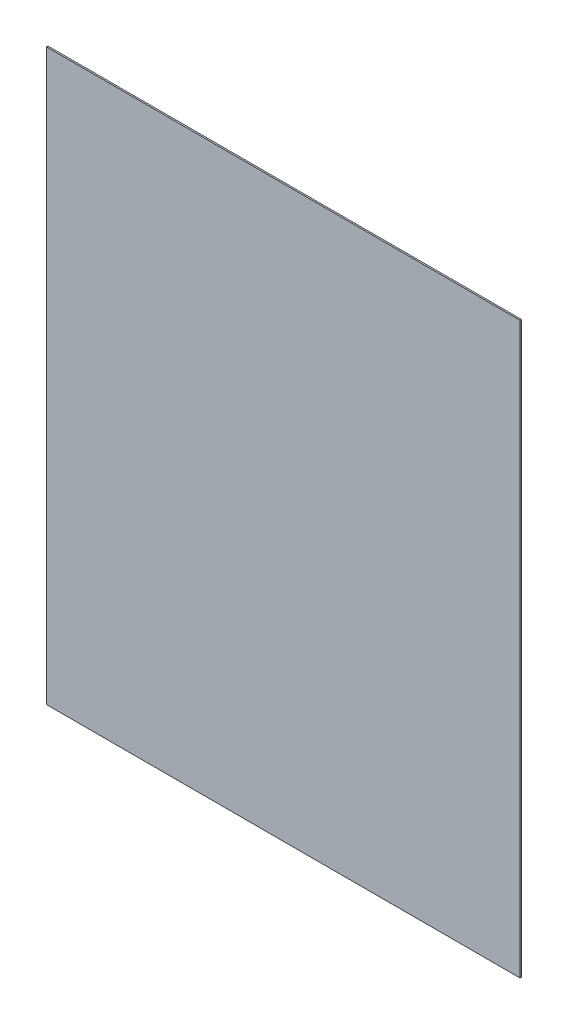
ISO-10303-21;
HEADER;
FILE_DESCRIPTION(('STEP AP214'),'2;1');
FILE_NAME('part.step','',(''),(''),'','','');
FILE_SCHEMA(('AUTOMOTIVE_DESIGN { 1 0 10303 214 1 1 1 1 }'));
ENDSEC;
DATA;
#1=APPLICATION_CONTEXT('core data for automotive mechanical design processes');
#2=APPLICATION_PROTOCOL_DEFINITION('international standard','automotive_design',2000,#1);
#3=PRODUCT_CONTEXT('',#1,'mechanical');
#4=PRODUCT('Part','Part','',(#3));
#5=PRODUCT_RELATED_PRODUCT_CATEGORY('part','',(#4));
#6=PRODUCT_DEFINITION_FORMATION('','',#4);
#7=PRODUCT_DEFINITION_CONTEXT('part definition',#1,'design');
#8=PRODUCT_DEFINITION('design','',#6,#7);
#9=PRODUCT_DEFINITION_SHAPE('','',#8);
#10=(LENGTH_UNIT() NAMED_UNIT(*) SI_UNIT(.MILLI.,.METRE.));
#11=(NAMED_UNIT(*) PLANE_ANGLE_UNIT() SI_UNIT($,.RADIAN.));
#12=(NAMED_UNIT(*) SI_UNIT($,.STERADIAN.) SOLID_ANGLE_UNIT());
#13=UNCERTAINTY_MEASURE_WITH_UNIT(LENGTH_MEASURE(1.E-05),#10,'distance_accuracy_value','');
#14=(GEOMETRIC_REPRESENTATION_CONTEXT(3) GLOBAL_UNCERTAINTY_ASSIGNED_CONTEXT((#13)) GLOBAL_UNIT_ASSIGNED_CONTEXT((#10,
#11,#12)) REPRESENTATION_CONTEXT('',''));
#15=CARTESIAN_POINT('',(0.,0.,0.));
#16=DIRECTION('',(0.,0.,1.));
#17=DIRECTION('',(1.,0.,0.));
#18=AXIS2_PLACEMENT_3D('',#15,#16,#17);
#19=CARTESIAN_POINT('',(1131.77469107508,464.304711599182,0.5));
#20=DIRECTION('',(0.,1.,0.));
#21=DIRECTION('',(0.,0.,1.));
#22=AXIS2_PLACEMENT_3D('',#19,#20,#21);
#23=PLANE('',#22);
#24=DIRECTION('',(1.,0.,0.));
#25=VECTOR('',#24,1.);
#26=CARTESIAN_POINT('',(1131.77469107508,464.304711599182,0.5));
#27=LINE('',#26,#25);
#28=CARTESIAN_POINT('',(1132.77469107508,464.304711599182,0.5));
#29=VERTEX_POINT('',#28);
#30=CARTESIAN_POINT('',(1290.77469103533,464.304711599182,0.5));
#31=VERTEX_POINT('',#30);
#32=EDGE_CURVE('E91',#29,#31,#27,.T.);
#33=ORIENTED_EDGE('',*,*,#32,.F.);
#34=DIRECTION('',(0.,0.,-1.));
#35=VECTOR('',#34,1.);
#36=CARTESIAN_POINT('',(1132.77469107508,464.304711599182,0.5));
#37=LINE('',#36,#35);
#38=CARTESIAN_POINT('',(1132.77469107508,464.304711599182,0.));
#39=VERTEX_POINT('',#38);
#40=EDGE_CURVE('E96',#29,#39,#37,.T.);
#41=ORIENTED_EDGE('',*,*,#40,.T.);
#42=DIRECTION('',(1.,0.,0.));
#43=VECTOR('',#42,1.);
#44=CARTESIAN_POINT('',(1131.77469107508,464.304711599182,0.));
#45=LINE('',#44,#43);
#46=CARTESIAN_POINT('',(1290.77469103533,464.304711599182,0.));
#47=VERTEX_POINT('',#46);
#48=EDGE_CURVE('E83',#39,#47,#45,.T.);
#49=ORIENTED_EDGE('',*,*,#48,.T.);
#50=DIRECTION('',(0.,0.,-1.));
#51=VECTOR('',#50,1.);
#52=CARTESIAN_POINT('',(1290.77469103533,464.304711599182,0.5));
#53=LINE('',#52,#51);
#54=EDGE_CURVE('E45',#31,#47,#53,.T.);
#55=ORIENTED_EDGE('',*,*,#54,.F.);
#56=EDGE_LOOP('',(#33,#41,#49,#55));
#57=FACE_BOUND('',#56,.T.);
#58=ADVANCED_FACE('F38',(#57),#23,.F.);
#59=CARTESIAN_POINT('',(1290.77469103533,464.304711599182,0.5));
#60=DIRECTION('',(-1.,0.,0.));
#61=DIRECTION('',(0.,0.,1.));
#62=AXIS2_PLACEMENT_3D('',#59,#60,#61);
#63=PLANE('',#62);
#64=DIRECTION('',(0.,1.,0.));
#65=VECTOR('',#64,1.);
#66=CARTESIAN_POINT('',(1290.77469103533,464.304711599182,0.));
#67=LINE('',#66,#65);
#68=CARTESIAN_POINT('',(1290.77469103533,654.304711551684,0.));
#69=VERTEX_POINT('',#68);
#70=EDGE_CURVE('E73',#47,#69,#67,.T.);
#71=ORIENTED_EDGE('',*,*,#70,.T.);
#72=DIRECTION('',(0.,0.,-1.));
#73=VECTOR('',#72,1.);
#74=CARTESIAN_POINT('',(1290.77469103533,654.304711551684,0.5));
#75=LINE('',#74,#73);
#76=CARTESIAN_POINT('',(1290.77469103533,654.304711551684,0.5));
#77=VERTEX_POINT('',#76);
#78=EDGE_CURVE('E76',#77,#69,#75,.T.);
#79=ORIENTED_EDGE('',*,*,#78,.F.);
#80=DIRECTION('',(0.,1.,0.));
#81=VECTOR('',#80,1.);
#82=CARTESIAN_POINT('',(1290.77469103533,464.304711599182,0.5));
#83=LINE('',#82,#81);
#84=EDGE_CURVE('E60',#31,#77,#83,.T.);
#85=ORIENTED_EDGE('',*,*,#84,.F.);
#86=ORIENTED_EDGE('',*,*,#54,.T.);
#87=EDGE_LOOP('',(#71,#79,#85,#86));
#88=FACE_BOUND('',#87,.T.);
#89=ADVANCED_FACE('F75',(#88),#63,.F.);
#90=CARTESIAN_POINT('',(1290.77469103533,654.304711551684,0.5));
#91=DIRECTION('',(0.,-1.,0.));
#92=DIRECTION('',(0.,0.,-1.));
#93=AXIS2_PLACEMENT_3D('',#90,#91,#92);
#94=PLANE('',#93);
#95=DIRECTION('',(-1.,0.,0.));
#96=VECTOR('',#95,1.);
#97=CARTESIAN_POINT('',(1290.77469103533,654.304711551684,0.));
#98=LINE('',#97,#96);
#99=CARTESIAN_POINT('',(1132.77469107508,654.304711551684,0.));
#100=VERTEX_POINT('',#99);
#101=EDGE_CURVE('E82',#69,#100,#98,.T.);
#102=ORIENTED_EDGE('',*,*,#101,.T.);
#103=DIRECTION('',(0.,0.,1.));
#104=VECTOR('',#103,1.);
#105=CARTESIAN_POINT('',(1132.77469107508,654.304711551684,0.5));
#106=LINE('',#105,#104);
#107=CARTESIAN_POINT('',(1132.77469107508,654.304711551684,0.5));
#108=VERTEX_POINT('',#107);
#109=EDGE_CURVE('E52',#100,#108,#106,.T.);
#110=ORIENTED_EDGE('',*,*,#109,.T.);
#111=DIRECTION('',(-1.,0.,0.));
#112=VECTOR('',#111,1.);
#113=CARTESIAN_POINT('',(1290.77469103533,654.304711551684,0.5));
#114=LINE('',#113,#112);
#115=EDGE_CURVE('E88',#77,#108,#114,.T.);
#116=ORIENTED_EDGE('',*,*,#115,.F.);
#117=ORIENTED_EDGE('',*,*,#78,.T.);
#118=EDGE_LOOP('',(#102,#110,#116,#117));
#119=FACE_BOUND('',#118,.T.);
#120=ADVANCED_FACE('F87',(#119),#94,.F.);
#121=CARTESIAN_POINT('',(0.,0.,0.5));
#122=DIRECTION('',(0.,0.,1.));
#123=DIRECTION('',(1.,0.,0.));
#124=AXIS2_PLACEMENT_3D('',#121,#122,#123);
#125=PLANE('',#124);
#126=DIRECTION('',(0.,1.,0.));
#127=VECTOR('',#126,1.);
#128=CARTESIAN_POINT('',(1132.77469107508,659.702583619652,0.5));
#129=LINE('',#128,#127);
#130=EDGE_CURVE('E102',#29,#108,#129,.T.);
#131=ORIENTED_EDGE('',*,*,#130,.F.);
#132=ORIENTED_EDGE('',*,*,#32,.T.);
#133=ORIENTED_EDGE('',*,*,#84,.T.);
#134=ORIENTED_EDGE('',*,*,#115,.T.);
#135=EDGE_LOOP('',(#131,#132,#133,#134));
#136=FACE_BOUND('',#135,.T.);
#137=ADVANCED_FACE('F110',(#136),#125,.T.);
#138=CARTESIAN_POINT('',(0.,0.,0.));
#139=DIRECTION('',(0.,0.,1.));
#140=DIRECTION('',(1.,0.,0.));
#141=AXIS2_PLACEMENT_3D('',#138,#139,#140);
#142=PLANE('',#141);
#143=ORIENTED_EDGE('',*,*,#48,.F.);
#144=DIRECTION('',(0.,1.,0.));
#145=VECTOR('',#144,1.);
#146=CARTESIAN_POINT('',(1132.77469107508,0.,0.));
#147=LINE('',#146,#145);
#148=EDGE_CURVE('E11',#39,#100,#147,.T.);
#149=ORIENTED_EDGE('',*,*,#148,.T.);
#150=ORIENTED_EDGE('',*,*,#101,.F.);
#151=ORIENTED_EDGE('',*,*,#70,.F.);
#152=EDGE_LOOP('',(#143,#149,#150,#151));
#153=FACE_BOUND('',#152,.T.);
#154=ADVANCED_FACE('F90',(#153),#142,.F.);
#155=CARTESIAN_POINT('',(1132.77469107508,659.702583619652,0.));
#156=DIRECTION('',(1.,0.,0.));
#157=DIRECTION('',(0.,0.,-1.));
#158=AXIS2_PLACEMENT_3D('',#155,#156,#157);
#159=PLANE('',#158);
#160=ORIENTED_EDGE('',*,*,#130,.T.);
#161=ORIENTED_EDGE('',*,*,#109,.F.);
#162=ORIENTED_EDGE('',*,*,#148,.F.);
#163=ORIENTED_EDGE('',*,*,#40,.F.);
#164=EDGE_LOOP('',(#160,#161,#162,#163));
#165=FACE_BOUND('',#164,.T.);
#166=ADVANCED_FACE('F106',(#165),#159,.F.);
#167=CLOSED_SHELL('',(#58,#89,#120,#137,#154,#166));
#168=MANIFOLD_SOLID_BREP('B2',#167);
#169=ADVANCED_BREP_SHAPE_REPRESENTATION('',(#18,#168),#14);
#170=SHAPE_DEFINITION_REPRESENTATION(#9,#169);
ENDSEC;
END-ISO-10303-21;
